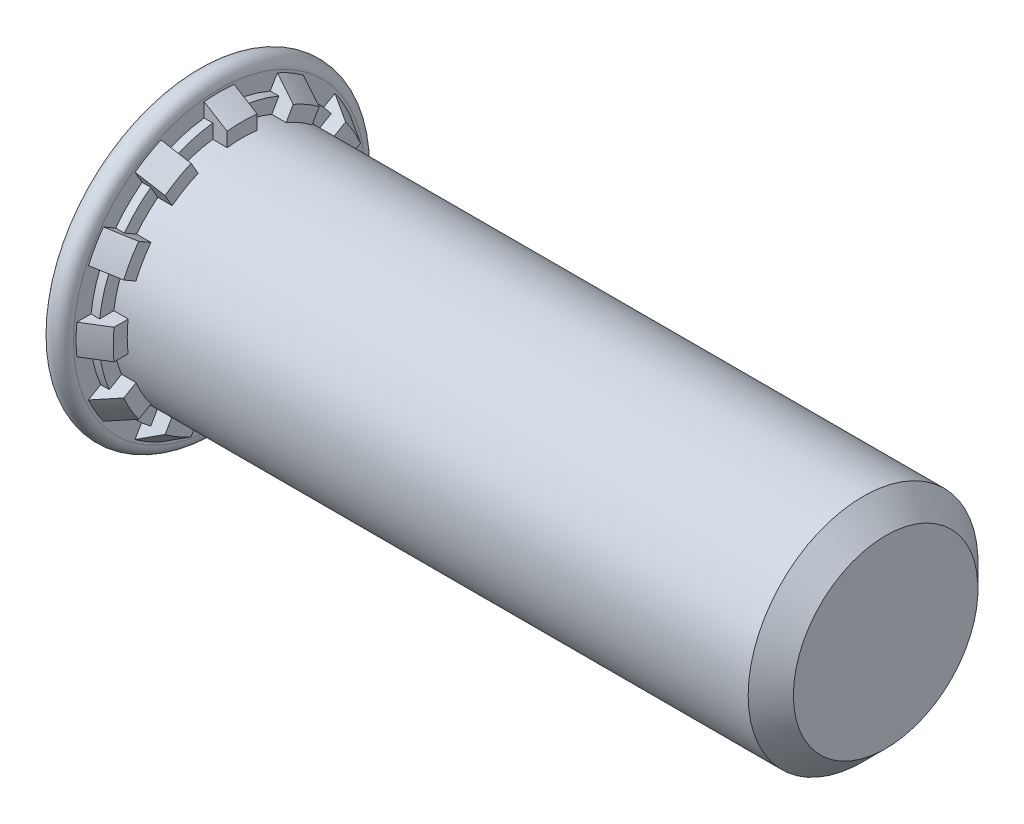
from build123d import *

# Parameters (mm, degrees)
RIBCUT1_DEPTH    = 0.375
RIBCUT2_DEPTH    = 0.6
RIBCUTSPAT_COUNT = 12
RIBCUTSPAT_ANGLE = 330


with BuildPart() as part:
    # BodySke → BaseBody (revolve)
    with BuildSketch(Plane.XY, mode=Mode.PRIVATE) as basebody_sk:
        with BuildLine():
            Line((0, 0), (0, 3.79746))
            Line((0, 3.79746), (0.00508, 3.79746))
            Line((0.00508, 3.79746), (0.00508, 3.80254))
            ThreePointArc((0.00508, 3.80254), (0.30254, 4.1), (0.6, 3.80254))
            Line((0.6, 3.80254), (0.6, 3.735))
            Line((0.6, 3.735), (1.2, 3.3675))
            Line((1.2, 3.3675), (1.2, 3))
            Line((1.2, 3), (17.4095, 3))
            Line((17.4095, 3), (18, 2.4095))
            Line((18, 2.4095), (18, 0))
            Line((18, 0), (0, 0))
        make_face()
    revolve(basebody_sk.sketch.rotate(Axis((0, 0, 0), (1, 0, 0)), 90), axis=Axis((0, 0, 0), (1, 0, 0)))

    # RibCut1Ske → RibCut1 (cut)
    with BuildSketch(Plane(origin=(1.2, 0, 0), x_dir=(0, 0, -1), z_dir=(1, 0, 0))):
        with BuildLine():
            Line((0.391578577, 2.974334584), (0.391578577, 4.081257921))
            ThreePointArc((0.391578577, 4.081257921), (1.061158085, 3.960295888), (1.701511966, 3.730262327))
            Line((1.701511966, 3.730262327), (1.148050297, 2.771638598))
            ThreePointArc((1.148050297, 2.771638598), (0.776457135, 2.897777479), (0.391578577, 2.974334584))
        make_face()
    ribcut1 = extrude(amount=-RIBCUT1_DEPTH, mode=Mode.SUBTRACT)

    # RibCut2Ske → RibCut2 (cut)
    with BuildSketch(Plane(origin=(1.2, 0, 0), x_dir=(0, 0, -1), z_dir=(1, 0, 0))):
        with BuildLine():
            Line((0.391578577, 3.344655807), (0.391578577, 4.081257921))
            ThreePointArc((0.391578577, 4.081257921), (1.061158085, 3.960295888), (1.701511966, 3.730262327))
            Line((1.701511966, 3.730262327), (1.333210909, 3.092346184))
            ThreePointArc((1.333210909, 3.092346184), (0.871573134, 3.25275522), (0.391578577, 3.344655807))
        make_face()
    ribcut2 = extrude(amount=-RIBCUT2_DEPTH, mode=Mode.SUBTRACT)

    # RibCutsPat: RibCut1, RibCut2 ×12 about axis
    ribcutspat_axis = Axis((0, 0, 0), (1, 0, 0))
    add([ribcut1.rotate(ribcutspat_axis, i * RIBCUTSPAT_ANGLE / (RIBCUTSPAT_COUNT - 1)) for i in range(1, RIBCUTSPAT_COUNT)], mode=Mode.SUBTRACT)
    add([ribcut2.rotate(ribcutspat_axis, i * RIBCUTSPAT_ANGLE / (RIBCUTSPAT_COUNT - 1)) for i in range(1, RIBCUTSPAT_COUNT)], mode=Mode.SUBTRACT)


solid = part.part
